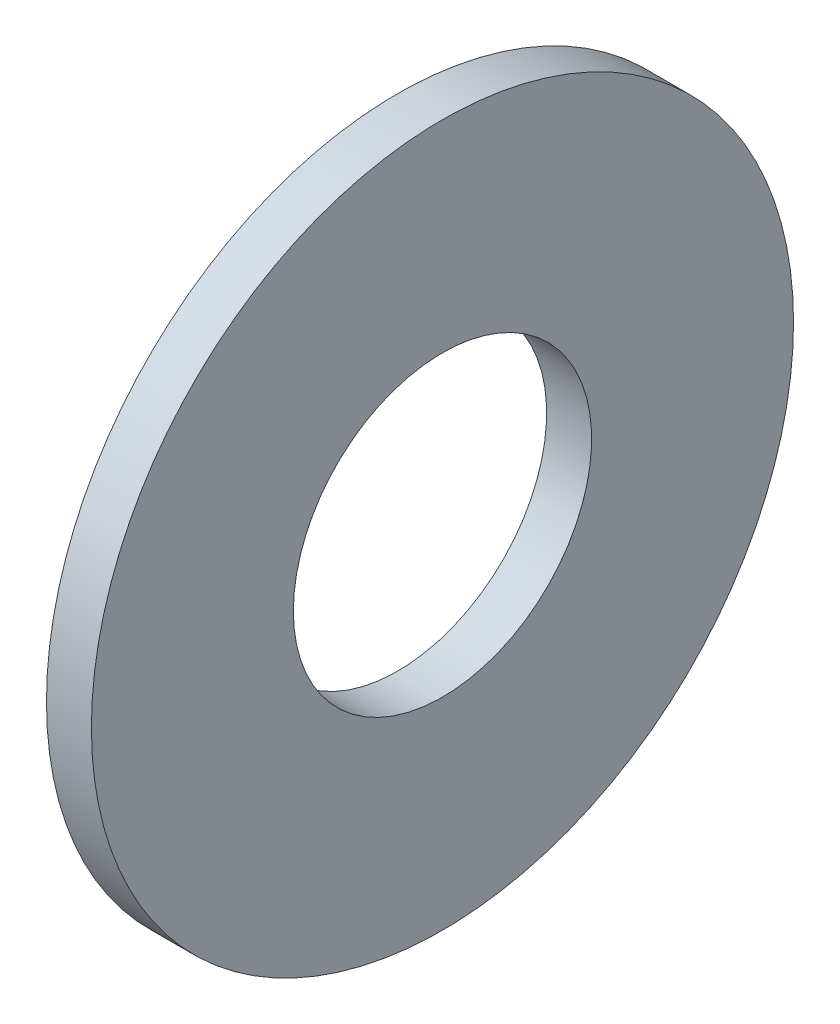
ISO-10303-21;
HEADER;
FILE_DESCRIPTION(('STEP AP214'),'2;1');
FILE_NAME('part.step','',(''),(''),'','','');
FILE_SCHEMA(('AUTOMOTIVE_DESIGN { 1 0 10303 214 1 1 1 1 }'));
ENDSEC;
DATA;
#1=APPLICATION_CONTEXT('core data for automotive mechanical design processes');
#2=APPLICATION_PROTOCOL_DEFINITION('international standard','automotive_design',2000,#1);
#3=PRODUCT_CONTEXT('',#1,'mechanical');
#4=PRODUCT('Part','Part','',(#3));
#5=PRODUCT_RELATED_PRODUCT_CATEGORY('part','',(#4));
#6=PRODUCT_DEFINITION_FORMATION('','',#4);
#7=PRODUCT_DEFINITION_CONTEXT('part definition',#1,'design');
#8=PRODUCT_DEFINITION('design','',#6,#7);
#9=PRODUCT_DEFINITION_SHAPE('','',#8);
#10=(LENGTH_UNIT() NAMED_UNIT(*) SI_UNIT(.MILLI.,.METRE.));
#11=(NAMED_UNIT(*) PLANE_ANGLE_UNIT() SI_UNIT($,.RADIAN.));
#12=(NAMED_UNIT(*) SI_UNIT($,.STERADIAN.) SOLID_ANGLE_UNIT());
#13=UNCERTAINTY_MEASURE_WITH_UNIT(LENGTH_MEASURE(1.E-05),#10,'distance_accuracy_value','');
#14=(GEOMETRIC_REPRESENTATION_CONTEXT(3) GLOBAL_UNCERTAINTY_ASSIGNED_CONTEXT((#13)) GLOBAL_UNIT_ASSIGNED_CONTEXT((#10,
#11,#12)) REPRESENTATION_CONTEXT('',''));
#15=CARTESIAN_POINT('',(0.,0.,0.));
#16=DIRECTION('',(0.,0.,1.));
#17=DIRECTION('',(1.,0.,0.));
#18=AXIS2_PLACEMENT_3D('',#15,#16,#17);
#19=CARTESIAN_POINT('',(-34.9249999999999,0.,0.));
#20=DIRECTION('',(-1.,0.,0.));
#21=DIRECTION('',(0.,0.,1.));
#22=AXIS2_PLACEMENT_3D('',#19,#20,#21);
#23=CYLINDRICAL_SURFACE('',#22,13.4874);
#24=CARTESIAN_POINT('',(0.,0.,0.));
#25=DIRECTION('',(-1.,0.,0.));
#26=DIRECTION('',(0.,0.,1.));
#27=AXIS2_PLACEMENT_3D('',#24,#25,#26);
#28=CIRCLE('',#27,13.4874);
#29=CARTESIAN_POINT('',(0.,0.,13.4874));
#30=VERTEX_POINT('',#29);
#31=EDGE_CURVE('E10',#30,#30,#28,.T.);
#32=ORIENTED_EDGE('',*,*,#31,.F.);
#33=EDGE_LOOP('',(#32));
#34=FACE_BOUND('',#33,.T.);
#35=CARTESIAN_POINT('',(-4.06399999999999,0.,0.));
#36=DIRECTION('',(-1.,0.,0.));
#37=DIRECTION('',(0.,0.,1.));
#38=AXIS2_PLACEMENT_3D('',#35,#36,#37);
#39=CIRCLE('',#38,13.4874);
#40=CARTESIAN_POINT('',(-4.06399999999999,0.,13.4874));
#41=VERTEX_POINT('',#40);
#42=EDGE_CURVE('E51',#41,#41,#39,.T.);
#43=ORIENTED_EDGE('',*,*,#42,.T.);
#44=EDGE_LOOP('',(#43));
#45=FACE_BOUND('',#44,.T.);
#46=ADVANCED_FACE('F37',(#34,#45),#23,.F.);
#47=CARTESIAN_POINT('',(0.,13.4874,0.));
#48=DIRECTION('',(-1.,0.,0.));
#49=DIRECTION('',(0.,0.,1.));
#50=AXIS2_PLACEMENT_3D('',#47,#48,#49);
#51=PLANE('',#50);
#52=CARTESIAN_POINT('',(0.,0.,0.));
#53=DIRECTION('',(-1.,0.,0.));
#54=DIRECTION('',(0.,0.,1.));
#55=AXIS2_PLACEMENT_3D('',#52,#53,#54);
#56=CIRCLE('',#55,31.75);
#57=CARTESIAN_POINT('',(0.,0.,31.75));
#58=VERTEX_POINT('',#57);
#59=EDGE_CURVE('E43',#58,#58,#56,.T.);
#60=ORIENTED_EDGE('',*,*,#59,.F.);
#61=EDGE_LOOP('',(#60));
#62=FACE_BOUND('',#61,.T.);
#63=ORIENTED_EDGE('',*,*,#31,.T.);
#64=EDGE_LOOP('',(#63));
#65=FACE_BOUND('',#64,.T.);
#66=ADVANCED_FACE('F66',(#62,#65),#51,.F.);
#67=CARTESIAN_POINT('',(-34.9249999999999,0.,0.));
#68=DIRECTION('',(-1.,0.,0.));
#69=DIRECTION('',(0.,0.,1.));
#70=AXIS2_PLACEMENT_3D('',#67,#68,#69);
#71=CYLINDRICAL_SURFACE('',#70,31.75);
#72=CARTESIAN_POINT('',(-4.064,0.,0.));
#73=DIRECTION('',(-1.,0.,0.));
#74=DIRECTION('',(0.,0.,1.));
#75=AXIS2_PLACEMENT_3D('',#72,#73,#74);
#76=CIRCLE('',#75,31.75);
#77=CARTESIAN_POINT('',(-4.064,0.,31.75));
#78=VERTEX_POINT('',#77);
#79=EDGE_CURVE('E47',#78,#78,#76,.T.);
#80=ORIENTED_EDGE('',*,*,#79,.F.);
#81=EDGE_LOOP('',(#80));
#82=FACE_BOUND('',#81,.T.);
#83=ORIENTED_EDGE('',*,*,#59,.T.);
#84=EDGE_LOOP('',(#83));
#85=FACE_BOUND('',#84,.T.);
#86=ADVANCED_FACE('F61',(#82,#85),#71,.T.);
#87=CARTESIAN_POINT('',(-4.064,31.75,0.));
#88=DIRECTION('',(1.,0.,0.));
#89=DIRECTION('',(0.,0.,-1.));
#90=AXIS2_PLACEMENT_3D('',#87,#88,#89);
#91=PLANE('',#90);
#92=ORIENTED_EDGE('',*,*,#42,.F.);
#93=EDGE_LOOP('',(#92));
#94=FACE_BOUND('',#93,.T.);
#95=ORIENTED_EDGE('',*,*,#79,.T.);
#96=EDGE_LOOP('',(#95));
#97=FACE_BOUND('',#96,.T.);
#98=ADVANCED_FACE('F58',(#94,#97),#91,.F.);
#99=CLOSED_SHELL('',(#46,#66,#86,#98));
#100=MANIFOLD_SOLID_BREP('B2',#99);
#101=ADVANCED_BREP_SHAPE_REPRESENTATION('',(#18,#100),#14);
#102=SHAPE_DEFINITION_REPRESENTATION(#9,#101);
ENDSEC;
END-ISO-10303-21;
